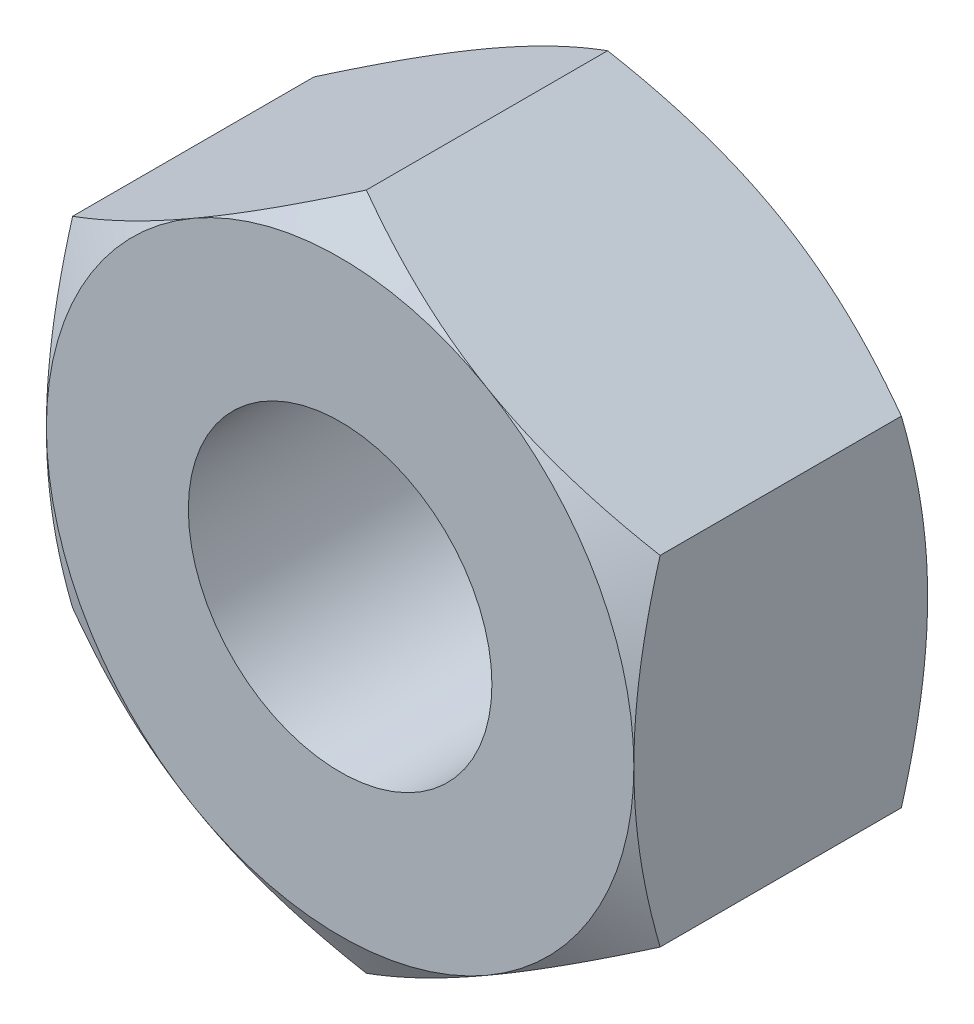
ISO-10303-21;
HEADER;
FILE_DESCRIPTION(('STEP AP214'),'2;1');
FILE_NAME('part.step','',(''),(''),'','','');
FILE_SCHEMA(('AUTOMOTIVE_DESIGN { 1 0 10303 214 1 1 1 1 }'));
ENDSEC;
DATA;
#1=APPLICATION_CONTEXT('core data for automotive mechanical design processes');
#2=APPLICATION_PROTOCOL_DEFINITION('international standard','automotive_design',2000,#1);
#3=PRODUCT_CONTEXT('',#1,'mechanical');
#4=PRODUCT('Part','Part','',(#3));
#5=PRODUCT_RELATED_PRODUCT_CATEGORY('part','',(#4));
#6=PRODUCT_DEFINITION_FORMATION('','',#4);
#7=PRODUCT_DEFINITION_CONTEXT('part definition',#1,'design');
#8=PRODUCT_DEFINITION('design','',#6,#7);
#9=PRODUCT_DEFINITION_SHAPE('','',#8);
#10=(LENGTH_UNIT() NAMED_UNIT(*) SI_UNIT(.MILLI.,.METRE.));
#11=(NAMED_UNIT(*) PLANE_ANGLE_UNIT() SI_UNIT($,.RADIAN.));
#12=(NAMED_UNIT(*) SI_UNIT($,.STERADIAN.) SOLID_ANGLE_UNIT());
#13=UNCERTAINTY_MEASURE_WITH_UNIT(LENGTH_MEASURE(1.E-05),#10,'distance_accuracy_value','');
#14=(GEOMETRIC_REPRESENTATION_CONTEXT(3) GLOBAL_UNCERTAINTY_ASSIGNED_CONTEXT((#13)) GLOBAL_UNIT_ASSIGNED_CONTEXT((#10,
#11,#12)) REPRESENTATION_CONTEXT('',''));
#15=CARTESIAN_POINT('',(0.,0.,0.));
#16=DIRECTION('',(0.,0.,1.));
#17=DIRECTION('',(1.,0.,0.));
#18=AXIS2_PLACEMENT_3D('',#15,#16,#17);
#19=CARTESIAN_POINT('',(13.,19.0358983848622,-72.));
#20=DIRECTION('',(-0.500000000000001,-0.866025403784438,0.));
#21=DIRECTION('',(0.866025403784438,-0.500000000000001,0.));
#22=AXIS2_PLACEMENT_3D('',#19,#20,#21);
#23=PLANE('',#22);
#24=CARTESIAN_POINT('',(12.9999999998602,19.0358983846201,-73.9999999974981));
#25=CARTESIAN_POINT('',(12.91511122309,19.0849089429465,-74.0000163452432));
#26=CARTESIAN_POINT('',(12.8302265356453,19.1339171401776,-73.9979201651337));
#27=CARTESIAN_POINT('',(12.6606238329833,19.2318373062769,-73.989624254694));
#28=CARTESIAN_POINT('',(12.5759057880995,19.280749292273,-73.9834253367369));
#29=CARTESIAN_POINT('',(12.4071835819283,19.3781611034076,-73.9670862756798));
#30=CARTESIAN_POINT('',(12.3231779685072,19.4266617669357,-73.9569659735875));
#31=CARTESIAN_POINT('',(12.15556697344,19.5234320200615,-73.9330018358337));
#32=CARTESIAN_POINT('',(12.0719616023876,19.5717016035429,-73.9191579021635));
#33=CARTESIAN_POINT('',(11.8220924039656,19.7159636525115,-73.872468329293));
#34=CARTESIAN_POINT('',(11.6565544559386,19.8115370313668,-73.8344422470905));
#35=CARTESIAN_POINT('',(11.3269021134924,20.0018619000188,-73.7467443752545));
#36=CARTESIAN_POINT('',(11.1627992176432,20.096606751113,-73.6970144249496));
#37=CARTESIAN_POINT('',(11.0000000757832,20.190598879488,-73.6427344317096));
#38=B_SPLINE_CURVE_WITH_KNOTS('',3,(#24,#25,#26,#27,#28,#29,#30,#31,#32,#33,#34,#35,#36,#37),
.UNSPECIFIED.,.F.,.F.,(4,2,2,2,2,2,4),(0.,0.294033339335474,0.588008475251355,0.880515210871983,
1.17302964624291,1.75729184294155,2.34452114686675),.UNSPECIFIED.);
#39=CARTESIAN_POINT('',(13.0000000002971,19.0358983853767,-73.9999999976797));
#40=VERTEX_POINT('',#39);
#41=CARTESIAN_POINT('',(11.000000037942,20.1905989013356,-73.6427344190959));
#42=VERTEX_POINT('',#41);
#43=EDGE_CURVE('E119',#40,#42,#38,.T.);
#44=ORIENTED_EDGE('',*,*,#43,.F.);
#45=CARTESIAN_POINT('',(15.0000000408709,17.8811978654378,-73.6427343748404));
#46=CARTESIAN_POINT('',(14.8372008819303,17.9751899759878,-73.6970143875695));
#47=CARTESIAN_POINT('',(14.6730979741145,18.0699348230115,-73.7467443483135));
#48=CARTESIAN_POINT('',(14.3434456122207,18.2602596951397,-73.834442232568));
#49=CARTESIAN_POINT('',(14.177907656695,18.3558330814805,-73.8724683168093));
#50=CARTESIAN_POINT('',(13.9280384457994,18.5000951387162,-73.9191578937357));
#51=CARTESIAN_POINT('',(13.8444330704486,18.5483647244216,-73.9330018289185));
#52=CARTESIAN_POINT('',(13.6768220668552,18.6451349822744,-73.9569659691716));
#53=CARTESIAN_POINT('',(13.5928164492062,18.6936356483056,-73.9670862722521));
#54=CARTESIAN_POINT('',(13.4240942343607,18.7910474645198,-73.9834253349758));
#55=CARTESIAN_POINT('',(13.3393761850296,18.8399594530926,-73.9896242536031));
#56=CARTESIAN_POINT('',(13.1697734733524,18.9378796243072,-73.9979201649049));
#57=CARTESIAN_POINT('',(13.0848887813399,18.9868878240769,-74.0000163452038));
#58=CARTESIAN_POINT('',(12.9999999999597,19.0358983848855,-73.9999999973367));
#59=B_SPLINE_CURVE_WITH_KNOTS('',3,(#45,#46,#47,#48,#49,#50,#51,#52,#53,#54,#55,#56,#57,#58),
.UNSPECIFIED.,.F.,.F.,(4,2,2,2,2,2,4),(0.,0.58722933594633,1.17149156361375,1.4640060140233,
1.75651276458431,2.05048791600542,2.34452127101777),.UNSPECIFIED.);
#60=CARTESIAN_POINT('',(15.0000000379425,17.881197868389,-73.642734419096));
#61=VERTEX_POINT('',#60);
#62=EDGE_CURVE('E228',#61,#40,#59,.T.);
#63=ORIENTED_EDGE('',*,*,#62,.F.);
#64=DIRECTION('',(0.,0.,1.));
#65=VECTOR('',#64,1.);
#66=CARTESIAN_POINT('',(15.,17.881197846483,-72.));
#67=LINE('',#66,#65);
#68=CARTESIAN_POINT('',(15.0000000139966,17.881197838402,-70.3572655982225));
#69=VERTEX_POINT('',#68);
#70=EDGE_CURVE('E306',#69,#61,#67,.F.);
#71=ORIENTED_EDGE('',*,*,#70,.F.);
#72=CARTESIAN_POINT('',(12.9999999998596,19.0358983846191,-70.0000000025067));
#73=CARTESIAN_POINT('',(13.0848887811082,18.9868878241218,-69.9999836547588));
#74=CARTESIAN_POINT('',(13.1697734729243,18.9378796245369,-70.0020798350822));
#75=CARTESIAN_POINT('',(13.3393761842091,18.8399594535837,-70.0103757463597));
#76=CARTESIAN_POINT('',(13.4240942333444,18.7910474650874,-70.0165746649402));
#77=CARTESIAN_POINT('',(13.5928164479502,18.6936356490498,-70.0329137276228));
#78=CARTESIAN_POINT('',(13.6768220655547,18.6451349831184,-70.043034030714));
#79=CARTESIAN_POINT('',(13.8444330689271,18.5483647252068,-70.0669981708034));
#80=CARTESIAN_POINT('',(13.9280384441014,18.5000951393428,-70.0808421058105));
#81=CARTESIAN_POINT('',(14.1779076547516,18.3558330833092,-70.1275316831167));
#82=CARTESIAN_POINT('',(14.3434456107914,18.2602596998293,-70.1655577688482));
#83=CARTESIAN_POINT('',(14.6730979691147,18.0699348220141,-70.2532556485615));
#84=CARTESIAN_POINT('',(14.8372008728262,17.9751899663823,-70.3029856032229));
#85=CARTESIAN_POINT('',(15.0000000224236,17.8811978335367,-70.3572656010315));
#86=B_SPLINE_CURVE_WITH_KNOTS('',3,(#72,#73,#74,#75,#76,#77,#78,#79,#80,#81,#82,#83,#84,#85),
.UNSPECIFIED.,.F.,.F.,(4,2,2,2,2,2,4),(0.,0.294033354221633,0.588008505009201,0.880515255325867,
1.17302970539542,1.75729193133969,2.34452126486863),.UNSPECIFIED.);
#87=CARTESIAN_POINT('',(13.0000000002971,19.0358983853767,-70.0000000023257));
#88=VERTEX_POINT('',#87);
#89=EDGE_CURVE('E246',#88,#69,#86,.T.);
#90=ORIENTED_EDGE('',*,*,#89,.F.);
#91=CARTESIAN_POINT('',(11.0000000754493,20.1905988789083,-70.3572655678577));
#92=CARTESIAN_POINT('',(11.1627992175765,20.09660675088,-70.302985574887));
#93=CARTESIAN_POINT('',(11.3269021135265,20.0018618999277,-70.2532556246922));
#94=CARTESIAN_POINT('',(11.6565544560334,19.8115370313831,-70.1655577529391));
#95=CARTESIAN_POINT('',(11.8220924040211,19.715963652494,-70.1275316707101));
#96=CARTESIAN_POINT('',(12.0719616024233,19.571701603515,-70.0808420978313));
#97=CARTESIAN_POINT('',(12.1555669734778,19.5234320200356,-70.0669981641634));
#98=CARTESIAN_POINT('',(12.3231779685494,19.4266617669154,-70.0430340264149));
#99=CARTESIAN_POINT('',(12.4071835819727,19.3781611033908,-70.0329137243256));
#100=CARTESIAN_POINT('',(12.5759057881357,19.2807492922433,-70.0165746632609));
#101=CARTESIAN_POINT('',(12.660623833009,19.2318373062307,-70.0103757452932));
#102=CARTESIAN_POINT('',(12.8302265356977,19.1339171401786,-70.0020798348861));
#103=CARTESIAN_POINT('',(12.9151112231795,19.0849089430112,-69.9999836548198));
#104=CARTESIAN_POINT('',(13.0000000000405,19.0358983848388,-70.0000000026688));
#105=B_SPLINE_CURVE_WITH_KNOTS('',3,(#91,#92,#93,#94,#95,#96,#97,#98,#99,#100,#101,#102,#103,
#104),.UNSPECIFIED.,.F.,.F.,(4,2,2,2,2,2,4),(0.,0.587229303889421,1.17149150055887,
1.46400593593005,1.75651267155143,2.0504878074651,2.34452114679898),.UNSPECIFIED.);
#106=CARTESIAN_POINT('',(11.,20.190598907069,-70.3572655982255));
#107=VERTEX_POINT('',#106);
#108=EDGE_CURVE('E253',#107,#88,#105,.T.);
#109=ORIENTED_EDGE('',*,*,#108,.F.);
#110=DIRECTION('',(0.,0.,1.));
#111=VECTOR('',#110,1.);
#112=CARTESIAN_POINT('',(11.,20.1905989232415,-72.));
#113=LINE('',#112,#111);
#114=EDGE_CURVE('E302',#42,#107,#113,.T.);
#115=ORIENTED_EDGE('',*,*,#114,.F.);
#116=EDGE_LOOP('',(#44,#63,#71,#90,#109,#115));
#117=FACE_BOUND('',#116,.T.);
#118=ADVANCED_FACE('F15',(#117),#23,.T.);
#119=CARTESIAN_POINT('',(11.,22.5,-72.));
#120=DIRECTION('',(-1.,0.,0.));
#121=DIRECTION('',(0.,0.,1.));
#122=AXIS2_PLACEMENT_3D('',#119,#120,#121);
#123=PLANE('',#122);
#124=CARTESIAN_POINT('',(10.9999999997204,22.5,-73.9999999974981));
#125=CARTESIAN_POINT('',(10.9999999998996,22.5980211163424,-74.0000163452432));
#126=CARTESIAN_POINT('',(10.9999999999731,22.6960375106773,-73.9979201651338));
#127=CARTESIAN_POINT('',(11.0000000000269,22.8918778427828,-73.989624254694));
#128=CARTESIAN_POINT('',(11.0000000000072,22.9897018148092,-73.9834253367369));
#129=CARTESIAN_POINT('',(10.9999999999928,23.1845254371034,-73.9670862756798));
#130=CARTESIAN_POINT('',(10.999999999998,23.2815267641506,-73.9569659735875));
#131=CARTESIAN_POINT('',(11.000000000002,23.4750672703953,-73.9330018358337));
#132=CARTESIAN_POINT('',(11.0000000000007,23.5716064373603,-73.9191579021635));
#133=CARTESIAN_POINT('',(10.9999999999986,23.8601305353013,-73.8724683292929));
#134=CARTESIAN_POINT('',(10.9999999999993,24.0512772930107,-73.8344422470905));
#135=CARTESIAN_POINT('',(11.0000000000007,24.4319270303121,-73.7467443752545));
#136=CARTESIAN_POINT('',(11.0000000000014,24.6214167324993,-73.6970144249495));
#137=CARTESIAN_POINT('',(11.,24.8094009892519,-73.6427344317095));
#138=B_SPLINE_CURVE_WITH_KNOTS('',3,(#124,#125,#126,#127,#128,#129,#130,#131,#132,#133,#134,
#135,#136,#137),.UNSPECIFIED.,.F.,.F.,(4,2,2,2,2,2,4),(0.,0.294033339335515,0.588008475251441,
0.880515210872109,1.17302964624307,1.75729184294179,2.34452114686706),.UNSPECIFIED.);
#139=CARTESIAN_POINT('',(11.0000000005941,22.5,-73.9999999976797));
#140=VERTEX_POINT('',#139);
#141=CARTESIAN_POINT('',(11.,24.809401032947,-73.6427344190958));
#142=VERTEX_POINT('',#141);
#143=EDGE_CURVE('E116',#140,#142,#138,.T.);
#144=ORIENTED_EDGE('',*,*,#143,.F.);
#145=CARTESIAN_POINT('',(11.0000000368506,20.1905988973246,-73.6427343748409));
#146=CARTESIAN_POINT('',(11.0000000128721,20.3785831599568,-73.6970143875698));
#147=CARTESIAN_POINT('',(11.0000000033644,20.568072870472,-73.7467443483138));
#148=CARTESIAN_POINT('',(10.9999999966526,20.9487226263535,-73.8344422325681));
#149=CARTESIAN_POINT('',(10.9999999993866,21.1398693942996,-73.8724683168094));
#150=CARTESIAN_POINT('',(11.0000000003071,21.4283935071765,-73.9191578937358));
#151=CARTESIAN_POINT('',(11.0000000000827,21.5249326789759,-73.9330018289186));
#152=CARTESIAN_POINT('',(10.9999999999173,21.718473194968,-73.9569659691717));
#153=CARTESIAN_POINT('',(10.9999999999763,21.8154745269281,-73.9670862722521));
#154=CARTESIAN_POINT('',(11.0000000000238,22.0102981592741,-73.9834253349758));
#155=CARTESIAN_POINT('',(11.0000000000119,22.1081221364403,-73.9896242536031));
#156=CARTESIAN_POINT('',(10.9999999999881,22.3039624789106,-73.9979201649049));
#157=CARTESIAN_POINT('',(10.9999999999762,22.4019788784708,-74.0000163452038));
#158=CARTESIAN_POINT('',(11.,22.5000000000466,-73.9999999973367));
#159=B_SPLINE_CURVE_WITH_KNOTS('',3,(#145,#146,#147,#148,#149,#150,#151,#152,#153,#154,#155,
#156,#157,#158),.UNSPECIFIED.,.F.,.F.,(4,2,2,2,2,2,4),(0.,0.587229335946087,1.17149156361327,
1.4640060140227,1.75651276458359,2.05048791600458,2.34452127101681),.UNSPECIFIED.);
#160=EDGE_CURVE('E333',#42,#140,#159,.T.);
#161=ORIENTED_EDGE('',*,*,#160,.F.);
#162=ORIENTED_EDGE('',*,*,#114,.T.);
#163=CARTESIAN_POINT('',(10.9999999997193,22.5,-70.0000000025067));
#164=CARTESIAN_POINT('',(10.9999999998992,22.4019788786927,-69.9999836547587));
#165=CARTESIAN_POINT('',(10.999999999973,22.3039624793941,-70.0020798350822));
#166=CARTESIAN_POINT('',(11.000000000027,22.1081221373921,-70.0103757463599));
#167=CARTESIAN_POINT('',(11.0000000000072,22.0102981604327,-70.0165746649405));
#168=CARTESIAN_POINT('',(10.9999999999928,21.8154745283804,-70.0329137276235));
#169=CARTESIAN_POINT('',(10.999999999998,21.7184731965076,-70.0430340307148));
#170=CARTESIAN_POINT('',(11.000000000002,21.5249326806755,-70.0669981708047));
#171=CARTESIAN_POINT('',(11.0000000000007,21.4283935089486,-70.0808421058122));
#172=CARTESIAN_POINT('',(10.9999999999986,21.1398693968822,-70.1275316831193));
#173=CARTESIAN_POINT('',(10.9999999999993,20.9487226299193,-70.1655577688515));
#174=CARTESIAN_POINT('',(11.0000000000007,20.5680728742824,-70.2532556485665));
#175=CARTESIAN_POINT('',(11.0000000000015,20.3785831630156,-70.3029856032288));
#176=CARTESIAN_POINT('',(11.,20.1905988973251,-70.3572656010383));
#177=B_SPLINE_CURVE_WITH_KNOTS('',3,(#163,#164,#165,#166,#167,#168,#169,#170,#171,#172,#173,
#174,#175,#176),.UNSPECIFIED.,.F.,.F.,(4,2,2,2,2,2,4),(0.,0.294033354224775,0.588008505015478,
0.88051525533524,1.17302970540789,1.75729193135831,2.34452126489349),.UNSPECIFIED.);
#178=CARTESIAN_POINT('',(11.0000000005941,22.5,-70.0000000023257));
#179=VERTEX_POINT('',#178);
#180=EDGE_CURVE('E258',#179,#107,#177,.T.);
#181=ORIENTED_EDGE('',*,*,#180,.F.);
#182=CARTESIAN_POINT('',(10.9999999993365,24.8094009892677,-70.3572655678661));
#183=CARTESIAN_POINT('',(10.9999999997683,24.6214167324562,-70.3029855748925));
#184=CARTESIAN_POINT('',(10.9999999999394,24.4319270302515,-70.2532556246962));
#185=CARTESIAN_POINT('',(11.0000000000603,24.0512772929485,-70.1655577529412));
#186=CARTESIAN_POINT('',(11.000000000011,23.8601305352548,-70.1275316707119));
#187=CARTESIAN_POINT('',(10.9999999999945,23.5716064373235,-70.0808420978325));
#188=CARTESIAN_POINT('',(10.9999999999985,23.475067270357,-70.0669981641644));
#189=CARTESIAN_POINT('',(11.0000000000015,23.2815267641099,-70.0430340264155));
#190=CARTESIAN_POINT('',(11.0000000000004,23.1845254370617,-70.032913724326));
#191=CARTESIAN_POINT('',(10.9999999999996,22.9897018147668,-70.0165746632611));
#192=CARTESIAN_POINT('',(10.9999999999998,22.8918778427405,-70.0103757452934));
#193=CARTESIAN_POINT('',(11.0000000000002,22.6960375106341,-70.0020798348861));
#194=CARTESIAN_POINT('',(11.0000000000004,22.598021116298,-69.9999836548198));
#195=CARTESIAN_POINT('',(11.,22.4999999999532,-70.0000000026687));
#196=B_SPLINE_CURVE_WITH_KNOTS('',3,(#182,#183,#184,#185,#186,#187,#188,#189,#190,#191,#192,
#193,#194,#195),.UNSPECIFIED.,.F.,.F.,(4,2,2,2,2,2,4),(0.,0.587229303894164,1.1714915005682,
1.46400593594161,1.7565126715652,2.05048780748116,2.34452114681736),.UNSPECIFIED.);
#197=CARTESIAN_POINT('',(10.9999999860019,24.8094010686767,-70.357265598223));
#198=VERTEX_POINT('',#197);
#199=EDGE_CURVE('E283',#198,#179,#196,.T.);
#200=ORIENTED_EDGE('',*,*,#199,.F.);
#201=DIRECTION('',(0.,0.,1.));
#202=VECTOR('',#201,1.);
#203=CARTESIAN_POINT('',(11.,24.8094010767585,-72.));
#204=LINE('',#203,#202);
#205=EDGE_CURVE('E334',#142,#198,#204,.T.);
#206=ORIENTED_EDGE('',*,*,#205,.F.);
#207=EDGE_LOOP('',(#144,#161,#162,#181,#200,#206));
#208=FACE_BOUND('',#207,.T.);
#209=ADVANCED_FACE('F241',(#208),#123,.T.);
#210=CARTESIAN_POINT('',(13.,25.9641016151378,-72.));
#211=DIRECTION('',(-0.500000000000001,0.866025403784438,0.));
#212=DIRECTION('',(-0.866025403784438,-0.500000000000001,0.));
#213=AXIS2_PLACEMENT_3D('',#210,#211,#212);
#214=PLANE('',#213);
#215=CARTESIAN_POINT('',(12.9999999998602,25.9641016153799,-73.9999999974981));
#216=CARTESIAN_POINT('',(13.0848887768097,26.013112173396,-74.0000163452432));
#217=CARTESIAN_POINT('',(13.1697734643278,26.0621203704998,-73.9979201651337));
#218=CARTESIAN_POINT('',(13.3393761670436,26.1600405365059,-73.989624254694));
#219=CARTESIAN_POINT('',(13.4240942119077,26.2089525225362,-73.9834253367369));
#220=CARTESIAN_POINT('',(13.5928164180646,26.3063643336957,-73.9670862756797));
#221=CARTESIAN_POINT('',(13.6768220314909,26.3548649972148,-73.9569659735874));
#222=CARTESIAN_POINT('',(13.844433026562,26.4516352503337,-73.9330018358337));
#223=CARTESIAN_POINT('',(13.9280383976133,26.4999048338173,-73.9191579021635));
#224=CARTESIAN_POINT('',(14.1779075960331,26.6441668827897,-73.8724683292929));
#225=CARTESIAN_POINT('',(14.3434455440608,26.7397402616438,-73.8344422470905));
#226=CARTESIAN_POINT('',(14.6730978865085,26.9300651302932,-73.7467443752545));
#227=CARTESIAN_POINT('',(14.8372007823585,27.0248099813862,-73.6970144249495));
#228=CARTESIAN_POINT('',(14.999999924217,27.1188021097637,-73.6427344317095));
#229=B_SPLINE_CURVE_WITH_KNOTS('',3,(#215,#216,#217,#218,#219,#220,#221,#222,#223,#224,#225,
#226,#227,#228),.UNSPECIFIED.,.F.,.F.,(4,2,2,2,2,2,4),(0.,0.29403333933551,0.588008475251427,
0.880515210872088,1.17302964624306,1.75729184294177,2.34452114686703),.UNSPECIFIED.);
#230=CARTESIAN_POINT('',(13.0000000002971,25.9641016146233,-73.9999999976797));
#231=VERTEX_POINT('',#230);
#232=CARTESIAN_POINT('',(14.9999999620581,27.1188021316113,-73.6427344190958));
#233=VERTEX_POINT('',#232);
#234=EDGE_CURVE('E19',#231,#233,#229,.T.);
#235=ORIENTED_EDGE('',*,*,#234,.F.);
#236=CARTESIAN_POINT('',(10.9999999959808,24.8094010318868,-73.642734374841));
#237=CARTESIAN_POINT('',(11.1627991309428,24.9033931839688,-73.6970143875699));
#238=CARTESIAN_POINT('',(11.3269020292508,24.9981380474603,-73.7467443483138));
#239=CARTESIAN_POINT('',(11.6565543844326,25.1884629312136,-73.8344422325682));
#240=CARTESIAN_POINT('',(11.8220923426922,25.284036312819,-73.8724683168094));
#241=CARTESIAN_POINT('',(12.0719615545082,25.4282983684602,-73.9191578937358));
#242=CARTESIAN_POINT('',(12.1555669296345,25.4765679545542,-73.9330018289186));
#243=CARTESIAN_POINT('',(12.3231779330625,25.5733382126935,-73.9569659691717));
#244=CARTESIAN_POINT('',(12.4071835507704,25.6218388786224,-73.9670862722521));
#245=CARTESIAN_POINT('',(12.5759057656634,25.7192506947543,-73.9834253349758));
#246=CARTESIAN_POINT('',(12.6606238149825,25.7681626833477,-73.9896242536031));
#247=CARTESIAN_POINT('',(12.8302265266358,25.8660828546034,-73.9979201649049));
#248=CARTESIAN_POINT('',(12.9151112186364,25.9150910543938,-74.0000163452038));
#249=CARTESIAN_POINT('',(13.0000000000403,25.9641016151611,-73.9999999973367));
#250=B_SPLINE_CURVE_WITH_KNOTS('',3,(#236,#237,#238,#239,#240,#241,#242,#243,#244,#245,#246,
#247,#248,#249),.UNSPECIFIED.,.F.,.F.,(4,2,2,2,2,2,4),(0.,0.587229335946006,1.17149156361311,
1.46400601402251,1.75651276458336,2.05048791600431,2.34452127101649),.UNSPECIFIED.);
#251=EDGE_CURVE('E110',#142,#231,#250,.T.);
#252=ORIENTED_EDGE('',*,*,#251,.F.);
#253=ORIENTED_EDGE('',*,*,#205,.T.);
#254=CARTESIAN_POINT('',(12.9999999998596,25.9641016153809,-70.0000000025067));
#255=CARTESIAN_POINT('',(12.9151112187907,25.9150910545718,-69.9999836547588));
#256=CARTESIAN_POINT('',(12.8302265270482,25.866082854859,-70.0020798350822));
#257=CARTESIAN_POINT('',(12.6606238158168,25.7681626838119,-70.0103757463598));
#258=CARTESIAN_POINT('',(12.5759057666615,25.7192506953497,-70.0165746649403));
#259=CARTESIAN_POINT('',(12.4071835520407,25.6218388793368,-70.0329137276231));
#260=CARTESIAN_POINT('',(12.3231779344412,25.5733382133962,-70.0430340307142));
#261=CARTESIAN_POINT('',(12.1555669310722,25.4765679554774,-70.0669981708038));
#262=CARTESIAN_POINT('',(12.0719615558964,25.4282983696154,-70.080842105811));
#263=CARTESIAN_POINT('',(11.8220923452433,25.2840363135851,-70.1275316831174));
#264=CARTESIAN_POINT('',(11.6565543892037,25.1884629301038,-70.1655577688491));
#265=CARTESIAN_POINT('',(11.3269020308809,24.9981380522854,-70.253255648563));
#266=CARTESIAN_POINT('',(11.1627991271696,24.9033931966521,-70.3029856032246));
#267=CARTESIAN_POINT('',(10.9999999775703,24.8094010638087,-70.3572656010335));
#268=B_SPLINE_CURVE_WITH_KNOTS('',3,(#254,#255,#256,#257,#258,#259,#260,#261,#262,#263,#264,
#265,#266,#267),.UNSPECIFIED.,.F.,.F.,(4,2,2,2,2,2,4),(0.,0.294033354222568,0.58800850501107,
0.880515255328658,1.17302970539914,1.75729193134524,2.34452126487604),.UNSPECIFIED.);
#269=CARTESIAN_POINT('',(13.0000000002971,25.9641016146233,-70.0000000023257));
#270=VERTEX_POINT('',#269);
#271=EDGE_CURVE('E278',#270,#198,#268,.T.);
#272=ORIENTED_EDGE('',*,*,#271,.F.);
#273=CARTESIAN_POINT('',(14.9999999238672,27.1188021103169,-70.3572655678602));
#274=CARTESIAN_POINT('',(14.8372007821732,27.0248099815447,-70.3029855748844));
#275=CARTESIAN_POINT('',(14.6730978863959,26.930065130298,-70.2532556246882));
#276=CARTESIAN_POINT('',(14.343445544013,26.7397402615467,-70.1655577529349));
#277=CARTESIAN_POINT('',(14.1779075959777,26.6441668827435,-70.1275316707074));
#278=CARTESIAN_POINT('',(13.9280383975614,26.4999048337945,-70.0808420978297));
#279=CARTESIAN_POINT('',(13.8444330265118,26.4516352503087,-70.066998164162));
#280=CARTESIAN_POINT('',(13.676822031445,26.3548649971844,-70.043034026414));
#281=CARTESIAN_POINT('',(13.5928164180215,26.3063643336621,-70.0329137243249));
#282=CARTESIAN_POINT('',(13.4240942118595,26.2089525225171,-70.0165746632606));
#283=CARTESIAN_POINT('',(13.3393761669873,26.1600405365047,-70.010375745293));
#284=CARTESIAN_POINT('',(13.1697734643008,26.0621203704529,-70.0020798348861));
#285=CARTESIAN_POINT('',(13.08488877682,26.0131121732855,-69.9999836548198));
#286=CARTESIAN_POINT('',(12.9999999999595,25.9641016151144,-70.0000000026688));
#287=B_SPLINE_CURVE_WITH_KNOTS('',3,(#273,#274,#275,#276,#277,#278,#279,#280,#281,#282,#283,
#284,#285,#286),.UNSPECIFIED.,.F.,.F.,(4,2,2,2,2,2,4),(0.,0.587229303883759,1.17149150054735,
1.46400593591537,1.75651267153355,2.05048780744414,2.34452114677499),.UNSPECIFIED.);
#288=CARTESIAN_POINT('',(14.9999999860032,27.1188021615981,-70.3572655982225));
#289=VERTEX_POINT('',#288);
#290=EDGE_CURVE('E291',#289,#270,#287,.T.);
#291=ORIENTED_EDGE('',*,*,#290,.F.);
#292=DIRECTION('',(0.,0.,1.));
#293=VECTOR('',#292,1.);
#294=CARTESIAN_POINT('',(15.,27.118802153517,-72.));
#295=LINE('',#294,#293);
#296=EDGE_CURVE('E125',#233,#289,#295,.T.);
#297=ORIENTED_EDGE('',*,*,#296,.F.);
#298=EDGE_LOOP('',(#235,#252,#253,#272,#291,#297));
#299=FACE_BOUND('',#298,.T.);
#300=ADVANCED_FACE('F123',(#299),#214,.T.);
#301=CARTESIAN_POINT('',(17.,25.9641016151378,-72.));
#302=DIRECTION('',(0.500000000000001,0.866025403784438,0.));
#303=DIRECTION('',(-0.866025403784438,0.500000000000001,0.));
#304=AXIS2_PLACEMENT_3D('',#301,#302,#303);
#305=PLANE('',#304);
#306=CARTESIAN_POINT('',(17.0000000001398,25.9641016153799,-73.9999999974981));
#307=CARTESIAN_POINT('',(17.08488877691,25.9150910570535,-74.0000163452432));
#308=CARTESIAN_POINT('',(17.1697734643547,25.8660828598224,-73.9979201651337));
#309=CARTESIAN_POINT('',(17.3393761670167,25.7681626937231,-73.989624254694));
#310=CARTESIAN_POINT('',(17.4240942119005,25.719250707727,-73.9834253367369));
#311=CARTESIAN_POINT('',(17.5928164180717,25.6218388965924,-73.9670862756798));
#312=CARTESIAN_POINT('',(17.6768220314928,25.5733382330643,-73.9569659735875));
#313=CARTESIAN_POINT('',(17.84443302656,25.4765679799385,-73.9330018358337));
#314=CARTESIAN_POINT('',(17.9280383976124,25.4282983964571,-73.9191579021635));
#315=CARTESIAN_POINT('',(18.1779075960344,25.2840363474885,-73.872468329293));
#316=CARTESIAN_POINT('',(18.3434455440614,25.1884629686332,-73.8344422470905));
#317=CARTESIAN_POINT('',(18.6730978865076,24.9981380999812,-73.7467443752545));
#318=CARTESIAN_POINT('',(18.8372007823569,24.903393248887,-73.6970144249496));
#319=CARTESIAN_POINT('',(18.9999999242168,24.809401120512,-73.6427344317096));
#320=B_SPLINE_CURVE_WITH_KNOTS('',3,(#306,#307,#308,#309,#310,#311,#312,#313,#314,#315,#316,
#317,#318,#319),.UNSPECIFIED.,.F.,.F.,(4,2,2,2,2,2,4),(0.,0.294033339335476,0.588008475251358,
0.880515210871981,1.17302964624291,1.75729184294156,2.34452114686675),.UNSPECIFIED.);
#321=CARTESIAN_POINT('',(16.9999999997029,25.9641016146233,-73.9999999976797));
#322=VERTEX_POINT('',#321);
#323=CARTESIAN_POINT('',(18.999999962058,24.8094010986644,-73.6427344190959));
#324=VERTEX_POINT('',#323);
#325=EDGE_CURVE('E191',#322,#324,#320,.T.);
#326=ORIENTED_EDGE('',*,*,#325,.F.);
#327=CARTESIAN_POINT('',(14.9999999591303,27.1188021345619,-73.642734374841));
#328=CARTESIAN_POINT('',(15.1627991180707,27.0248100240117,-73.6970143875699));
#329=CARTESIAN_POINT('',(15.3269020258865,26.930065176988,-73.7467443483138));
#330=CARTESIAN_POINT('',(15.65655438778,26.7397403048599,-73.8344422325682));
#331=CARTESIAN_POINT('',(15.8220923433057,26.6441669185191,-73.8724683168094));
#332=CARTESIAN_POINT('',(16.0719615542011,26.4999048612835,-73.9191578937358));
#333=CARTESIAN_POINT('',(16.1555669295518,26.4516352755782,-73.9330018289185));
#334=CARTESIAN_POINT('',(16.3231779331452,26.3548650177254,-73.9569659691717));
#335=CARTESIAN_POINT('',(16.4071835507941,26.3063643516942,-73.9670862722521));
#336=CARTESIAN_POINT('',(16.5759057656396,26.2089525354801,-73.9834253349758));
#337=CARTESIAN_POINT('',(16.6606238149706,26.1600405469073,-73.9896242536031));
#338=CARTESIAN_POINT('',(16.8302265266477,26.0621203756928,-73.9979201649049));
#339=CARTESIAN_POINT('',(16.9151112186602,26.013112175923,-74.0000163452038));
#340=CARTESIAN_POINT('',(17.0000000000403,25.9641016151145,-73.9999999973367));
#341=B_SPLINE_CURVE_WITH_KNOTS('',3,(#327,#328,#329,#330,#331,#332,#333,#334,#335,#336,#337,
#338,#339,#340),.UNSPECIFIED.,.F.,.F.,(4,2,2,2,2,2,4),(0.,0.587229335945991,1.17149156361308,
1.46400601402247,1.75651276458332,2.05048791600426,2.34452127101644),.UNSPECIFIED.);
#342=EDGE_CURVE('E129',#233,#322,#341,.T.);
#343=ORIENTED_EDGE('',*,*,#342,.F.);
#344=ORIENTED_EDGE('',*,*,#296,.T.);
#345=CARTESIAN_POINT('',(17.0000000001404,25.9641016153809,-70.0000000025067));
#346=CARTESIAN_POINT('',(16.9151112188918,26.0131121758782,-69.9999836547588));
#347=CARTESIAN_POINT('',(16.8302265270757,26.0621203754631,-70.0020798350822));
#348=CARTESIAN_POINT('',(16.6606238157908,26.1600405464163,-70.0103757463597));
#349=CARTESIAN_POINT('',(16.5759057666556,26.2089525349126,-70.0165746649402));
#350=CARTESIAN_POINT('',(16.4071835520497,26.3063643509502,-70.0329137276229));
#351=CARTESIAN_POINT('',(16.3231779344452,26.3548650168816,-70.043034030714));
#352=CARTESIAN_POINT('',(16.1555669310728,26.4516352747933,-70.0669981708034));
#353=CARTESIAN_POINT('',(16.0719615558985,26.4999048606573,-70.0808421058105));
#354=CARTESIAN_POINT('',(15.8220923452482,26.6441669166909,-70.1275316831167));
#355=CARTESIAN_POINT('',(15.6565543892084,26.7397403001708,-70.1655577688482));
#356=CARTESIAN_POINT('',(15.3269020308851,26.9300651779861,-70.2532556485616));
#357=CARTESIAN_POINT('',(15.1627991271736,27.0248100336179,-70.3029856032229));
#358=CARTESIAN_POINT('',(14.9999999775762,27.1188021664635,-70.3572656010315));
#359=B_SPLINE_CURVE_WITH_KNOTS('',3,(#345,#346,#347,#348,#349,#350,#351,#352,#353,#354,#355,
#356,#357,#358),.UNSPECIFIED.,.F.,.F.,(4,2,2,2,2,2,4),(0.,0.294033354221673,0.588008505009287,
0.880515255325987,1.17302970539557,1.75729193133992,2.34452126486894),.UNSPECIFIED.);
#360=CARTESIAN_POINT('',(16.9999999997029,25.9641016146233,-70.0000000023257));
#361=VERTEX_POINT('',#360);
#362=EDGE_CURVE('E393',#361,#289,#359,.T.);
#363=ORIENTED_EDGE('',*,*,#362,.F.);
#364=CARTESIAN_POINT('',(18.9999999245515,24.8094011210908,-70.3572655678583));
#365=CARTESIAN_POINT('',(18.8372007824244,24.9033932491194,-70.3029855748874));
#366=CARTESIAN_POINT('',(18.6730978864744,24.9981381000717,-70.2532556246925));
#367=CARTESIAN_POINT('',(18.3434455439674,25.1884629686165,-70.1655577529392));
#368=CARTESIAN_POINT('',(18.1779075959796,25.2840363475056,-70.1275316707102));
#369=CARTESIAN_POINT('',(17.9280383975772,25.4282983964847,-70.0808420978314));
#370=CARTESIAN_POINT('',(17.8444330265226,25.4765679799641,-70.0669981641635));
#371=CARTESIAN_POINT('',(17.676822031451,25.5733382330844,-70.043034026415));
#372=CARTESIAN_POINT('',(17.5928164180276,25.621838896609,-70.0329137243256));
#373=CARTESIAN_POINT('',(17.4240942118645,25.7192507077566,-70.0165746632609));
#374=CARTESIAN_POINT('',(17.3393761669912,25.7681626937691,-70.0103757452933));
#375=CARTESIAN_POINT('',(17.1697734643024,25.8660828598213,-70.0020798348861));
#376=CARTESIAN_POINT('',(17.0848887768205,25.9150910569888,-69.9999836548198));
#377=CARTESIAN_POINT('',(16.9999999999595,25.9641016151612,-70.0000000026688));
#378=B_SPLINE_CURVE_WITH_KNOTS('',3,(#364,#365,#366,#367,#368,#369,#370,#371,#372,#373,#374,
#375,#376,#377),.UNSPECIFIED.,.F.,.F.,(4,2,2,2,2,2,4),(0.,0.587229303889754,1.17149150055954,
1.46400593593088,1.75651267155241,2.05048780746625,2.34452114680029),.UNSPECIFIED.);
#379=CARTESIAN_POINT('',(19.,24.8094010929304,-70.3572655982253));
#380=VERTEX_POINT('',#379);
#381=EDGE_CURVE('E394',#380,#361,#378,.T.);
#382=ORIENTED_EDGE('',*,*,#381,.F.);
#383=DIRECTION('',(0.,0.,-1.));
#384=VECTOR('',#383,1.);
#385=CARTESIAN_POINT('',(19.,24.8094010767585,-72.));
#386=LINE('',#385,#384);
#387=EDGE_CURVE('E130',#324,#380,#386,.F.);
#388=ORIENTED_EDGE('',*,*,#387,.F.);
#389=EDGE_LOOP('',(#326,#343,#344,#363,#382,#388));
#390=FACE_BOUND('',#389,.T.);
#391=ADVANCED_FACE('F404',(#390),#305,.T.);
#392=CARTESIAN_POINT('',(17.,19.0358983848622,-72.));
#393=DIRECTION('',(0.500000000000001,-0.866025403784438,0.));
#394=DIRECTION('',(0.866025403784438,0.500000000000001,0.));
#395=AXIS2_PLACEMENT_3D('',#392,#393,#394);
#396=PLANE('',#395);
#397=CARTESIAN_POINT('',(15.0000000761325,17.8811978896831,-70.3572655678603));
#398=CARTESIAN_POINT('',(15.1627992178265,17.9751900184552,-70.3029855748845));
#399=CARTESIAN_POINT('',(15.3269021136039,18.0699348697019,-70.2532556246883));
#400=CARTESIAN_POINT('',(15.6565544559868,18.2602597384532,-70.165557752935));
#401=CARTESIAN_POINT('',(15.8220924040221,18.3558331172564,-70.1275316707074));
#402=CARTESIAN_POINT('',(16.0719616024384,18.5000951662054,-70.0808420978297));
#403=CARTESIAN_POINT('',(16.1555669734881,18.5483647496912,-70.066998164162));
#404=CARTESIAN_POINT('',(16.3231779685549,18.6451350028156,-70.043034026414));
#405=CARTESIAN_POINT('',(16.4071835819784,18.6936356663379,-70.0329137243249));
#406=CARTESIAN_POINT('',(16.5759057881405,18.7910474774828,-70.0165746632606));
#407=CARTESIAN_POINT('',(16.6606238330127,18.8399594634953,-70.010375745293));
#408=CARTESIAN_POINT('',(16.8302265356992,18.9378796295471,-70.0020798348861));
#409=CARTESIAN_POINT('',(16.9151112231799,18.9868878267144,-69.9999836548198));
#410=CARTESIAN_POINT('',(17.0000000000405,19.0358983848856,-70.0000000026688));
#411=B_SPLINE_CURVE_WITH_KNOTS('',3,(#397,#398,#399,#400,#401,#402,#403,#404,#405,#406,#407,
#408,#409,#410),.UNSPECIFIED.,.F.,.F.,(4,2,2,2,2,2,4),(0.,0.587229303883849,1.17149150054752,
1.46400593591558,1.7565126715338,2.05048780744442,2.34452114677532),.UNSPECIFIED.);
#412=CARTESIAN_POINT('',(16.9999999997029,19.0358983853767,-70.0000000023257));
#413=VERTEX_POINT('',#412);
#414=EDGE_CURVE('E190',#69,#413,#411,.T.);
#415=ORIENTED_EDGE('',*,*,#414,.F.);
#416=ORIENTED_EDGE('',*,*,#70,.T.);
#417=CARTESIAN_POINT('',(17.0000000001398,19.0358983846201,-73.9999999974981));
#418=CARTESIAN_POINT('',(16.9151112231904,18.9868878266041,-74.0000163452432));
#419=CARTESIAN_POINT('',(16.8302265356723,18.9378796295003,-73.9979201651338));
#420=CARTESIAN_POINT('',(16.6606238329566,18.8399594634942,-73.989624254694));
#421=CARTESIAN_POINT('',(16.5759057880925,18.791047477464,-73.9834253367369));
#422=CARTESIAN_POINT('',(16.4071835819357,18.6936356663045,-73.9670862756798));
#423=CARTESIAN_POINT('',(16.3231779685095,18.6451350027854,-73.9569659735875));
#424=CARTESIAN_POINT('',(16.1555669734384,18.5483647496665,-73.9330018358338));
#425=CARTESIAN_POINT('',(16.0719616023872,18.500095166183,-73.9191579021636));
#426=CARTESIAN_POINT('',(15.8220924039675,18.3558331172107,-73.8724683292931));
#427=CARTESIAN_POINT('',(15.6565544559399,18.2602597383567,-73.8344422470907));
#428=CARTESIAN_POINT('',(15.3269021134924,18.0699348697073,-73.7467443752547));
#429=CARTESIAN_POINT('',(15.1627992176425,17.9751900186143,-73.6970144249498));
#430=CARTESIAN_POINT('',(15.000000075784,17.8811978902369,-73.6427344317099));
#431=B_SPLINE_CURVE_WITH_KNOTS('',3,(#417,#418,#419,#420,#421,#422,#423,#424,#425,#426,#427,
#428,#429,#430),.UNSPECIFIED.,.F.,.F.,(4,2,2,2,2,2,4),(0.,0.294033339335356,0.588008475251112,
0.880515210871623,1.17302964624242,1.75729184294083,2.34452114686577),.UNSPECIFIED.);
#432=CARTESIAN_POINT('',(16.9999999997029,19.0358983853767,-73.9999999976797));
#433=VERTEX_POINT('',#432);
#434=EDGE_CURVE('E233',#433,#61,#431,.T.);
#435=ORIENTED_EDGE('',*,*,#434,.F.);
#436=CARTESIAN_POINT('',(18.999999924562,20.1905988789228,-73.6427344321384));
#437=CARTESIAN_POINT('',(18.8372007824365,20.0966067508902,-73.6970144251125));
#438=CARTESIAN_POINT('',(18.6730978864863,20.0018618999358,-73.746744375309));
#439=CARTESIAN_POINT('',(18.3434455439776,19.8115370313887,-73.8344422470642));
#440=CARTESIAN_POINT('',(18.1779075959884,19.7159636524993,-73.8724683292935));
#441=CARTESIAN_POINT('',(17.9280383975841,19.5717016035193,-73.9191579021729));
#442=CARTESIAN_POINT('',(17.8444330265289,19.5234320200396,-73.933001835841));
#443=CARTESIAN_POINT('',(17.6768220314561,19.4266617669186,-73.9569659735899));
#444=CARTESIAN_POINT('',(17.5928164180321,19.3781611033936,-73.9670862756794));
#445=CARTESIAN_POINT('',(17.4240942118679,19.2807492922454,-73.9834253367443));
#446=CARTESIAN_POINT('',(17.3393761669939,19.2318373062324,-73.989624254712));
#447=CARTESIAN_POINT('',(17.1697734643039,19.1339171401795,-73.9979201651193));
#448=CARTESIAN_POINT('',(17.0848887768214,19.0849089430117,-74.0000163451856));
#449=CARTESIAN_POINT('',(16.9999999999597,19.0358983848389,-73.9999999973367));
#450=B_SPLINE_CURVE_WITH_KNOTS('',3,(#436,#437,#438,#439,#440,#441,#442,#443,#444,#445,#446,
#447,#448,#449),.UNSPECIFIED.,.F.,.F.,(4,2,2,2,2,2,4),(0.,0.58722930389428,1.17149150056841,
1.46400593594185,1.75651267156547,2.05048780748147,2.34452114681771),.UNSPECIFIED.);
#451=CARTESIAN_POINT('',(19.,20.1905989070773,-73.6427344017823));
#452=VERTEX_POINT('',#451);
#453=EDGE_CURVE('E223',#452,#433,#450,.T.);
#454=ORIENTED_EDGE('',*,*,#453,.F.);
#455=DIRECTION('',(0.,0.,-1.));
#456=VECTOR('',#455,1.);
#457=CARTESIAN_POINT('',(19.,20.1905989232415,-72.));
#458=LINE('',#457,#456);
#459=CARTESIAN_POINT('',(18.9999999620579,20.1905989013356,-70.3572655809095));
#460=VERTEX_POINT('',#459);
#461=EDGE_CURVE('E429',#460,#452,#458,.T.);
#462=ORIENTED_EDGE('',*,*,#461,.F.);
#463=CARTESIAN_POINT('',(17.0000000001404,19.0358983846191,-70.0000000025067));
#464=CARTESIAN_POINT('',(17.0848887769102,19.0849089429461,-69.999983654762));
#465=CARTESIAN_POINT('',(17.1697734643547,19.1339171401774,-70.0020798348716));
#466=CARTESIAN_POINT('',(17.3393761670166,19.2318373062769,-70.0103757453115));
#467=CARTESIAN_POINT('',(17.4240942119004,19.280749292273,-70.0165746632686));
#468=CARTESIAN_POINT('',(17.5928164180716,19.3781611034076,-70.0329137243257));
#469=CARTESIAN_POINT('',(17.6768220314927,19.4266617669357,-70.043034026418));
#470=CARTESIAN_POINT('',(17.8444330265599,19.5234320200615,-70.0669981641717));
#471=CARTESIAN_POINT('',(17.9280383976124,19.5717016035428,-70.0808420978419));
#472=CARTESIAN_POINT('',(18.1779075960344,19.7159636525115,-70.1275316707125));
#473=CARTESIAN_POINT('',(18.3434455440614,19.8115370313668,-70.1655577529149));
#474=CARTESIAN_POINT('',(18.6730978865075,20.0018619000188,-70.2532556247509));
#475=CARTESIAN_POINT('',(18.8372007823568,20.096606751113,-70.3029855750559));
#476=CARTESIAN_POINT('',(18.9999999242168,20.190598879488,-70.3572655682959));
#477=B_SPLINE_CURVE_WITH_KNOTS('',3,(#463,#464,#465,#466,#467,#468,#469,#470,#471,#472,#473,
#474,#475,#476),.UNSPECIFIED.,.F.,.F.,(4,2,2,2,2,2,4),(0.,0.294033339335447,0.58800847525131,
0.880515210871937,1.17302964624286,1.75729184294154,2.34452114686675),.UNSPECIFIED.);
#478=EDGE_CURVE('E146',#413,#460,#477,.T.);
#479=ORIENTED_EDGE('',*,*,#478,.F.);
#480=EDGE_LOOP('',(#415,#416,#435,#454,#462,#479));
#481=FACE_BOUND('',#480,.T.);
#482=ADVANCED_FACE('F167',(#481),#396,.T.);
#483=CARTESIAN_POINT('',(19.,22.5,-72.));
#484=DIRECTION('',(1.,0.,0.));
#485=DIRECTION('',(0.,0.,-1.));
#486=AXIS2_PLACEMENT_3D('',#483,#484,#485);
#487=PLANE('',#486);
#488=CARTESIAN_POINT('',(19.0000000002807,22.5,-70.0000000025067));
#489=CARTESIAN_POINT('',(19.0000000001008,22.5980211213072,-69.9999836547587));
#490=CARTESIAN_POINT('',(19.000000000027,22.6960375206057,-70.0020798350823));
#491=CARTESIAN_POINT('',(18.999999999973,22.8918778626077,-70.0103757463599));
#492=CARTESIAN_POINT('',(18.9999999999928,22.989701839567,-70.0165746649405));
#493=CARTESIAN_POINT('',(19.0000000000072,23.1845254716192,-70.0329137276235));
#494=CARTESIAN_POINT('',(19.000000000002,23.281526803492,-70.0430340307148));
#495=CARTESIAN_POINT('',(18.999999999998,23.475067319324,-70.0669981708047));
#496=CARTESIAN_POINT('',(18.9999999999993,23.5716064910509,-70.0808421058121));
#497=CARTESIAN_POINT('',(19.0000000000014,23.8601306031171,-70.1275316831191));
#498=CARTESIAN_POINT('',(19.0000000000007,24.0512773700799,-70.1655577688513));
#499=CARTESIAN_POINT('',(18.9999999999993,24.4319271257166,-70.2532556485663));
#500=CARTESIAN_POINT('',(18.9999999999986,24.6214168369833,-70.3029856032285));
#501=CARTESIAN_POINT('',(19.,24.8094011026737,-70.357265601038));
#502=B_SPLINE_CURVE_WITH_KNOTS('',3,(#488,#489,#490,#491,#492,#493,#494,#495,#496,#497,#498,
#499,#500,#501),.UNSPECIFIED.,.F.,.F.,(4,2,2,2,2,2,4),(0.,0.294033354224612,0.588008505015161,
0.880515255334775,1.17302970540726,1.75729193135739,2.34452126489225),.UNSPECIFIED.);
#503=CARTESIAN_POINT('',(18.9999999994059,22.5,-70.0000000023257));
#504=VERTEX_POINT('',#503);
#505=EDGE_CURVE('E177',#504,#380,#502,.T.);
#506=ORIENTED_EDGE('',*,*,#505,.F.);
#507=CARTESIAN_POINT('',(18.9999999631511,20.1905988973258,-70.3572656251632));
#508=CARTESIAN_POINT('',(18.9999999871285,20.3785831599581,-70.3029856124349));
#509=CARTESIAN_POINT('',(18.9999999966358,20.5680728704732,-70.2532556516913));
#510=CARTESIAN_POINT('',(19.0000000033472,20.9487226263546,-70.1655577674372));
#511=CARTESIAN_POINT('',(19.0000000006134,21.1398693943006,-70.1275316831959));
#512=CARTESIAN_POINT('',(18.9999999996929,21.4283935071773,-70.0808421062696));
#513=CARTESIAN_POINT('',(18.9999999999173,21.5249326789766,-70.0669981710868));
#514=CARTESIAN_POINT('',(19.0000000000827,21.7184731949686,-70.0430340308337));
#515=CARTESIAN_POINT('',(19.0000000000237,21.8154745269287,-70.0329137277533));
#516=CARTESIAN_POINT('',(18.9999999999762,22.0102981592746,-70.0165746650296));
#517=CARTESIAN_POINT('',(18.9999999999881,22.1081221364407,-70.0103757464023));
#518=CARTESIAN_POINT('',(19.0000000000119,22.303962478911,-70.0020798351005));
#519=CARTESIAN_POINT('',(19.0000000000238,22.401978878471,-69.9999836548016));
#520=CARTESIAN_POINT('',(19.,22.5000000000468,-70.0000000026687));
#521=B_SPLINE_CURVE_WITH_KNOTS('',3,(#507,#508,#509,#510,#511,#512,#513,#514,#515,#516,#517,
#518,#519,#520),.UNSPECIFIED.,.F.,.F.,(4,2,2,2,2,2,4),(0.,0.587229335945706,1.17149156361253,
1.46400601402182,1.75651276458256,2.05048791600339,2.34452127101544),.UNSPECIFIED.);
#522=EDGE_CURVE('E144',#460,#504,#521,.T.);
#523=ORIENTED_EDGE('',*,*,#522,.F.);
#524=ORIENTED_EDGE('',*,*,#461,.T.);
#525=CARTESIAN_POINT('',(19.0000000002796,22.5,-73.9999999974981));
#526=CARTESIAN_POINT('',(19.0000000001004,22.4019788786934,-74.0000163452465));
#527=CARTESIAN_POINT('',(19.0000000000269,22.3039624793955,-73.9979201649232));
#528=CARTESIAN_POINT('',(18.9999999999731,22.1081221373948,-73.9896242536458));
#529=CARTESIAN_POINT('',(18.9999999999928,22.0102981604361,-73.9834253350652));
#530=CARTESIAN_POINT('',(19.0000000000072,21.8154745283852,-73.9670862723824));
#531=CARTESIAN_POINT('',(19.000000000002,21.7184731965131,-73.9569659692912));
#532=CARTESIAN_POINT('',(18.999999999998,21.5249326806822,-73.9330018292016));
#533=CARTESIAN_POINT('',(18.9999999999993,21.428393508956,-73.9191578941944));
#534=CARTESIAN_POINT('',(19.0000000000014,21.1398693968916,-73.8724683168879));
#535=CARTESIAN_POINT('',(19.0000000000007,20.94872262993,-73.8344422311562));
#536=CARTESIAN_POINT('',(18.9999999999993,20.5680728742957,-73.7467443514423));
#537=CARTESIAN_POINT('',(18.9999999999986,20.3785831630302,-73.6970143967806));
#538=CARTESIAN_POINT('',(19.,20.190598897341,-73.6427343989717));
#539=B_SPLINE_CURVE_WITH_KNOTS('',3,(#525,#526,#527,#528,#529,#530,#531,#532,#533,#534,#535,
#536,#537,#538),.UNSPECIFIED.,.F.,.F.,(4,2,2,2,2,2,4),(0.,0.294033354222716,0.588008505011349,
0.880515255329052,1.17302970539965,1.75729193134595,2.34452126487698),.UNSPECIFIED.);
#540=CARTESIAN_POINT('',(18.9999999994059,22.5,-73.9999999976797));
#541=VERTEX_POINT('',#540);
#542=EDGE_CURVE('E218',#541,#452,#539,.T.);
#543=ORIENTED_EDGE('',*,*,#542,.F.);
#544=CARTESIAN_POINT('',(18.9999999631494,24.8094011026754,-73.6427343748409));
#545=CARTESIAN_POINT('',(18.9999999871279,24.6214168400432,-73.6970143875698));
#546=CARTESIAN_POINT('',(18.9999999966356,24.431927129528,-73.7467443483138));
#547=CARTESIAN_POINT('',(19.0000000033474,24.0512773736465,-73.8344422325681));
#548=CARTESIAN_POINT('',(19.0000000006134,23.8601306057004,-73.8724683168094));
#549=CARTESIAN_POINT('',(18.9999999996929,23.5716064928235,-73.9191578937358));
#550=CARTESIAN_POINT('',(18.9999999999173,23.4750673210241,-73.9330018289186));
#551=CARTESIAN_POINT('',(19.0000000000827,23.281526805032,-73.9569659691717));
#552=CARTESIAN_POINT('',(19.0000000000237,23.1845254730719,-73.9670862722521));
#553=CARTESIAN_POINT('',(18.9999999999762,22.9897018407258,-73.9834253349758));
#554=CARTESIAN_POINT('',(18.9999999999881,22.8918778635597,-73.9896242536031));
#555=CARTESIAN_POINT('',(19.0000000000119,22.6960375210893,-73.9979201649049));
#556=CARTESIAN_POINT('',(19.0000000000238,22.5980211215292,-74.0000163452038));
#557=CARTESIAN_POINT('',(19.,22.4999999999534,-73.9999999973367));
#558=B_SPLINE_CURVE_WITH_KNOTS('',3,(#544,#545,#546,#547,#548,#549,#550,#551,#552,#553,#554,
#555,#556,#557),.UNSPECIFIED.,.F.,.F.,(4,2,2,2,2,2,4),(0.,0.587229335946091,1.17149156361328,
1.4640060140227,1.7565127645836,2.0504879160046,2.34452127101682),.UNSPECIFIED.);
#559=EDGE_CURVE('E183',#324,#541,#558,.T.);
#560=ORIENTED_EDGE('',*,*,#559,.F.);
#561=ORIENTED_EDGE('',*,*,#387,.T.);
#562=EDGE_LOOP('',(#506,#523,#524,#543,#560,#561));
#563=FACE_BOUND('',#562,.T.);
#564=ADVANCED_FACE('F164',(#563),#487,.T.);
#565=CARTESIAN_POINT('',(15.,22.5,-73.6405908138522));
#566=DIRECTION('',(0.,0.,1.));
#567=DIRECTION('',(1.,0.,0.));
#568=AXIS2_PLACEMENT_3D('',#565,#566,#567);
#569=CONICAL_SURFACE('',#568,4.62251496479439,1.0471975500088);
#570=ORIENTED_EDGE('',*,*,#342,.T.);
#571=CARTESIAN_POINT('',(15.,22.5,-73.9999999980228));
#572=DIRECTION('',(0.,0.,1.));
#573=DIRECTION('',(1.,0.,0.));
#574=AXIS2_PLACEMENT_3D('',#571,#572,#573);
#575=CIRCLE('',#574,3.99999999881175);
#576=EDGE_CURVE('E137',#322,#231,#575,.T.);
#577=ORIENTED_EDGE('',*,*,#576,.T.);
#578=ORIENTED_EDGE('',*,*,#234,.T.);
#579=EDGE_LOOP('',(#570,#577,#578));
#580=FACE_BOUND('',#579,.T.);
#581=ADVANCED_FACE('F143',(#580),#569,.T.);
#582=CARTESIAN_POINT('',(15.,22.5,-73.6405908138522));
#583=DIRECTION('',(0.,0.,1.));
#584=DIRECTION('',(1.,0.,0.));
#585=AXIS2_PLACEMENT_3D('',#582,#583,#584);
#586=CONICAL_SURFACE('',#585,4.62251496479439,1.0471975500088);
#587=ORIENTED_EDGE('',*,*,#251,.T.);
#588=CARTESIAN_POINT('',(15.,22.5,-73.9999999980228));
#589=DIRECTION('',(0.,0.,1.));
#590=DIRECTION('',(1.,0.,0.));
#591=AXIS2_PLACEMENT_3D('',#588,#589,#590);
#592=CIRCLE('',#591,3.99999999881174);
#593=EDGE_CURVE('E114',#231,#140,#592,.T.);
#594=ORIENTED_EDGE('',*,*,#593,.T.);
#595=ORIENTED_EDGE('',*,*,#143,.T.);
#596=EDGE_LOOP('',(#587,#594,#595));
#597=FACE_BOUND('',#596,.T.);
#598=ADVANCED_FACE('F112',(#597),#586,.T.);
#599=CARTESIAN_POINT('',(15.,22.5,-73.6405908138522));
#600=DIRECTION('',(0.,0.,1.));
#601=DIRECTION('',(1.,0.,0.));
#602=AXIS2_PLACEMENT_3D('',#599,#600,#601);
#603=CONICAL_SURFACE('',#602,4.62251496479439,1.0471975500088);
#604=ORIENTED_EDGE('',*,*,#160,.T.);
#605=CARTESIAN_POINT('',(15.,22.5,-73.9999999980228));
#606=DIRECTION('',(0.,0.,1.));
#607=DIRECTION('',(1.,0.,0.));
#608=AXIS2_PLACEMENT_3D('',#605,#606,#607);
#609=CIRCLE('',#608,3.99999999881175);
#610=EDGE_CURVE('E141',#140,#40,#609,.T.);
#611=ORIENTED_EDGE('',*,*,#610,.T.);
#612=ORIENTED_EDGE('',*,*,#43,.T.);
#613=EDGE_LOOP('',(#604,#611,#612));
#614=FACE_BOUND('',#613,.T.);
#615=ADVANCED_FACE('F332',(#614),#603,.T.);
#616=CARTESIAN_POINT('',(15.,22.5,-73.6405908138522));
#617=DIRECTION('',(0.,0.,1.));
#618=DIRECTION('',(1.,0.,0.));
#619=AXIS2_PLACEMENT_3D('',#616,#617,#618);
#620=CONICAL_SURFACE('',#619,4.62251496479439,1.0471975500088);
#621=ORIENTED_EDGE('',*,*,#62,.T.);
#622=CARTESIAN_POINT('',(15.,22.5,-73.9999999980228));
#623=DIRECTION('',(0.,0.,1.));
#624=DIRECTION('',(1.,0.,0.));
#625=AXIS2_PLACEMENT_3D('',#622,#623,#624);
#626=CIRCLE('',#625,3.99999999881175);
#627=EDGE_CURVE('E329',#40,#433,#626,.T.);
#628=ORIENTED_EDGE('',*,*,#627,.T.);
#629=ORIENTED_EDGE('',*,*,#434,.T.);
#630=EDGE_LOOP('',(#621,#628,#629));
#631=FACE_BOUND('',#630,.T.);
#632=ADVANCED_FACE('F213',(#631),#620,.T.);
#633=CARTESIAN_POINT('',(15.,22.5,-73.6405908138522));
#634=DIRECTION('',(0.,0.,1.));
#635=DIRECTION('',(1.,0.,0.));
#636=AXIS2_PLACEMENT_3D('',#633,#634,#635);
#637=CONICAL_SURFACE('',#636,4.62251496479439,1.0471975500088);
#638=CARTESIAN_POINT('',(15.,22.5,-73.9999999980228));
#639=DIRECTION('',(0.,0.,1.));
#640=DIRECTION('',(1.,0.,0.));
#641=AXIS2_PLACEMENT_3D('',#638,#639,#640);
#642=CIRCLE('',#641,3.99999999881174);
#643=EDGE_CURVE('E323',#433,#541,#642,.T.);
#644=ORIENTED_EDGE('',*,*,#643,.T.);
#645=ORIENTED_EDGE('',*,*,#542,.T.);
#646=ORIENTED_EDGE('',*,*,#453,.T.);
#647=EDGE_LOOP('',(#644,#645,#646));
#648=FACE_BOUND('',#647,.T.);
#649=ADVANCED_FACE('F205',(#648),#637,.T.);
#650=CARTESIAN_POINT('',(15.,22.5,-73.6405908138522));
#651=DIRECTION('',(0.,0.,1.));
#652=DIRECTION('',(1.,0.,0.));
#653=AXIS2_PLACEMENT_3D('',#650,#651,#652);
#654=CONICAL_SURFACE('',#653,4.62251496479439,1.0471975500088);
#655=ORIENTED_EDGE('',*,*,#559,.T.);
#656=CARTESIAN_POINT('',(15.,22.5,-73.9999999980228));
#657=DIRECTION('',(0.,0.,1.));
#658=DIRECTION('',(1.,0.,0.));
#659=AXIS2_PLACEMENT_3D('',#656,#657,#658);
#660=CIRCLE('',#659,3.99999999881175);
#661=EDGE_CURVE('E320',#541,#322,#660,.T.);
#662=ORIENTED_EDGE('',*,*,#661,.T.);
#663=ORIENTED_EDGE('',*,*,#325,.T.);
#664=EDGE_LOOP('',(#655,#662,#663));
#665=FACE_BOUND('',#664,.T.);
#666=ADVANCED_FACE('F200',(#665),#654,.T.);
#667=CARTESIAN_POINT('',(15.,22.5,-70.3594091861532));
#668=DIRECTION('',(0.,0.,-1.));
#669=DIRECTION('',(-1.,0.,0.));
#670=AXIS2_PLACEMENT_3D('',#667,#668,#669);
#671=CONICAL_SURFACE('',#670,4.62251496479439,1.0471975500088);
#672=CARTESIAN_POINT('',(15.,22.5,-70.0000000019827));
#673=DIRECTION('',(0.,0.,-1.));
#674=DIRECTION('',(-1.,0.,0.));
#675=AXIS2_PLACEMENT_3D('',#672,#673,#674);
#676=CIRCLE('',#675,3.99999999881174);
#677=EDGE_CURVE('E315',#413,#88,#676,.T.);
#678=ORIENTED_EDGE('',*,*,#677,.T.);
#679=ORIENTED_EDGE('',*,*,#89,.T.);
#680=ORIENTED_EDGE('',*,*,#414,.T.);
#681=EDGE_LOOP('',(#678,#679,#680));
#682=FACE_BOUND('',#681,.T.);
#683=ADVANCED_FACE('F204',(#682),#671,.T.);
#684=CARTESIAN_POINT('',(15.,22.5,-70.3594091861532));
#685=DIRECTION('',(0.,0.,-1.));
#686=DIRECTION('',(-1.,0.,0.));
#687=AXIS2_PLACEMENT_3D('',#684,#685,#686);
#688=CONICAL_SURFACE('',#687,4.62251496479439,1.0471975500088);
#689=CARTESIAN_POINT('',(15.,22.5,-70.0000000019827));
#690=DIRECTION('',(0.,0.,-1.));
#691=DIRECTION('',(-1.,0.,0.));
#692=AXIS2_PLACEMENT_3D('',#689,#690,#691);
#693=CIRCLE('',#692,3.99999999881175);
#694=EDGE_CURVE('E297',#88,#179,#693,.T.);
#695=ORIENTED_EDGE('',*,*,#694,.T.);
#696=ORIENTED_EDGE('',*,*,#180,.T.);
#697=ORIENTED_EDGE('',*,*,#108,.T.);
#698=EDGE_LOOP('',(#695,#696,#697));
#699=FACE_BOUND('',#698,.T.);
#700=ADVANCED_FACE('F263',(#699),#688,.T.);
#701=CARTESIAN_POINT('',(15.,22.5,-70.3594091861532));
#702=DIRECTION('',(0.,0.,-1.));
#703=DIRECTION('',(-1.,0.,0.));
#704=AXIS2_PLACEMENT_3D('',#701,#702,#703);
#705=CONICAL_SURFACE('',#704,4.62251496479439,1.0471975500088);
#706=CARTESIAN_POINT('',(15.,22.5,-70.0000000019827));
#707=DIRECTION('',(0.,0.,-1.));
#708=DIRECTION('',(-1.,0.,0.));
#709=AXIS2_PLACEMENT_3D('',#706,#707,#708);
#710=CIRCLE('',#709,3.99999999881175);
#711=EDGE_CURVE('E318',#179,#270,#710,.T.);
#712=ORIENTED_EDGE('',*,*,#711,.T.);
#713=ORIENTED_EDGE('',*,*,#271,.T.);
#714=ORIENTED_EDGE('',*,*,#199,.T.);
#715=EDGE_LOOP('',(#712,#713,#714));
#716=FACE_BOUND('',#715,.T.);
#717=ADVANCED_FACE('F267',(#716),#705,.T.);
#718=CARTESIAN_POINT('',(15.,22.5,-70.3594091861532));
#719=DIRECTION('',(0.,0.,-1.));
#720=DIRECTION('',(-1.,0.,0.));
#721=AXIS2_PLACEMENT_3D('',#718,#719,#720);
#722=CONICAL_SURFACE('',#721,4.62251496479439,1.0471975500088);
#723=CARTESIAN_POINT('',(15.,22.5,-70.0000000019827));
#724=DIRECTION('',(0.,0.,-1.));
#725=DIRECTION('',(-1.,0.,0.));
#726=AXIS2_PLACEMENT_3D('',#723,#724,#725);
#727=CIRCLE('',#726,3.99999999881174);
#728=EDGE_CURVE('E387',#270,#361,#727,.T.);
#729=ORIENTED_EDGE('',*,*,#728,.T.);
#730=ORIENTED_EDGE('',*,*,#362,.T.);
#731=ORIENTED_EDGE('',*,*,#290,.T.);
#732=EDGE_LOOP('',(#729,#730,#731));
#733=FACE_BOUND('',#732,.T.);
#734=ADVANCED_FACE('F273',(#733),#722,.T.);
#735=CARTESIAN_POINT('',(15.,22.5,-70.3594091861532));
#736=DIRECTION('',(0.,0.,-1.));
#737=DIRECTION('',(-1.,0.,0.));
#738=AXIS2_PLACEMENT_3D('',#735,#736,#737);
#739=CONICAL_SURFACE('',#738,4.62251496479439,1.0471975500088);
#740=CARTESIAN_POINT('',(15.,22.5,-70.0000000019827));
#741=DIRECTION('',(0.,0.,-1.));
#742=DIRECTION('',(-1.,0.,0.));
#743=AXIS2_PLACEMENT_3D('',#740,#741,#742);
#744=CIRCLE('',#743,3.99999999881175);
#745=EDGE_CURVE('E381',#361,#504,#744,.T.);
#746=ORIENTED_EDGE('',*,*,#745,.T.);
#747=ORIENTED_EDGE('',*,*,#505,.T.);
#748=ORIENTED_EDGE('',*,*,#381,.T.);
#749=EDGE_LOOP('',(#746,#747,#748));
#750=FACE_BOUND('',#749,.T.);
#751=ADVANCED_FACE('F376',(#750),#739,.T.);
#752=CARTESIAN_POINT('',(15.,22.5,-70.3594091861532));
#753=DIRECTION('',(0.,0.,-1.));
#754=DIRECTION('',(-1.,0.,0.));
#755=AXIS2_PLACEMENT_3D('',#752,#753,#754);
#756=CONICAL_SURFACE('',#755,4.62251496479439,1.0471975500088);
#757=ORIENTED_EDGE('',*,*,#522,.T.);
#758=CARTESIAN_POINT('',(15.,22.5,-70.0000000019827));
#759=DIRECTION('',(0.,0.,-1.));
#760=DIRECTION('',(-1.,0.,0.));
#761=AXIS2_PLACEMENT_3D('',#758,#759,#760);
#762=CIRCLE('',#761,3.99999999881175);
#763=EDGE_CURVE('E378',#504,#413,#762,.T.);
#764=ORIENTED_EDGE('',*,*,#763,.T.);
#765=ORIENTED_EDGE('',*,*,#478,.T.);
#766=EDGE_LOOP('',(#757,#764,#765));
#767=FACE_BOUND('',#766,.T.);
#768=ADVANCED_FACE('F160',(#767),#756,.T.);
#769=CARTESIAN_POINT('',(15.,22.5,-74.));
#770=DIRECTION('',(0.,0.,1.));
#771=DIRECTION('',(1.,0.,0.));
#772=AXIS2_PLACEMENT_3D('',#769,#770,#771);
#773=PLANE('',#772);
#774=CARTESIAN_POINT('',(15.,22.5,-74.));
#775=DIRECTION('',(0.,0.,-1.));
#776=DIRECTION('',(-1.,0.,0.));
#777=AXIS2_PLACEMENT_3D('',#774,#775,#776);
#778=CIRCLE('',#777,2.067);
#779=CARTESIAN_POINT('',(12.933,22.5,-74.));
#780=VERTEX_POINT('',#779);
#781=EDGE_CURVE('E30',#780,#780,#778,.F.);
#782=ORIENTED_EDGE('',*,*,#781,.T.);
#783=EDGE_LOOP('',(#782));
#784=FACE_BOUND('',#783,.T.);
#785=ORIENTED_EDGE('',*,*,#643,.F.);
#786=ORIENTED_EDGE('',*,*,#627,.F.);
#787=ORIENTED_EDGE('',*,*,#610,.F.);
#788=ORIENTED_EDGE('',*,*,#593,.F.);
#789=ORIENTED_EDGE('',*,*,#576,.F.);
#790=ORIENTED_EDGE('',*,*,#661,.F.);
#791=EDGE_LOOP('',(#785,#786,#787,#788,#789,#790));
#792=FACE_BOUND('',#791,.T.);
#793=ADVANCED_FACE('F135',(#784,#792),#773,.F.);
#794=CARTESIAN_POINT('',(15.,22.5,-70.));
#795=DIRECTION('',(0.,0.,-1.));
#796=DIRECTION('',(-1.,0.,0.));
#797=AXIS2_PLACEMENT_3D('',#794,#795,#796);
#798=PLANE('',#797);
#799=CARTESIAN_POINT('',(15.,22.5,-70.));
#800=DIRECTION('',(0.,0.,-1.));
#801=DIRECTION('',(-1.,0.,0.));
#802=AXIS2_PLACEMENT_3D('',#799,#800,#801);
#803=CIRCLE('',#802,2.067);
#804=CARTESIAN_POINT('',(17.067,22.5,-70.));
#805=VERTEX_POINT('',#804);
#806=EDGE_CURVE('E10',#805,#805,#803,.T.);
#807=ORIENTED_EDGE('',*,*,#806,.T.);
#808=EDGE_LOOP('',(#807));
#809=FACE_BOUND('',#808,.T.);
#810=ORIENTED_EDGE('',*,*,#745,.F.);
#811=ORIENTED_EDGE('',*,*,#728,.F.);
#812=ORIENTED_EDGE('',*,*,#711,.F.);
#813=ORIENTED_EDGE('',*,*,#694,.F.);
#814=ORIENTED_EDGE('',*,*,#677,.F.);
#815=ORIENTED_EDGE('',*,*,#763,.F.);
#816=EDGE_LOOP('',(#810,#811,#812,#813,#814,#815));
#817=FACE_BOUND('',#816,.T.);
#818=ADVANCED_FACE('F313',(#809,#817),#798,.F.);
#819=CARTESIAN_POINT('',(15.,22.5,-70.));
#820=DIRECTION('',(0.,0.,-1.));
#821=DIRECTION('',(-1.,0.,0.));
#822=AXIS2_PLACEMENT_3D('',#819,#820,#821);
#823=CYLINDRICAL_SURFACE('',#822,2.067);
#824=ORIENTED_EDGE('',*,*,#806,.F.);
#825=EDGE_LOOP('',(#824));
#826=FACE_BOUND('',#825,.T.);
#827=ORIENTED_EDGE('',*,*,#781,.F.);
#828=EDGE_LOOP('',(#827));
#829=FACE_BOUND('',#828,.T.);
#830=ADVANCED_FACE('F17',(#826,#829),#823,.F.);
#831=CLOSED_SHELL('',(#118,#209,#300,#391,#482,#564,#581,#598,#615,#632,#649,#666,#683,#700,
#717,#734,#751,#768,#793,#818,#830));
#832=MANIFOLD_SOLID_BREP('B1',#831);
#833=ADVANCED_BREP_SHAPE_REPRESENTATION('',(#18,#832),#14);
#834=SHAPE_DEFINITION_REPRESENTATION(#9,#833);
ENDSEC;
END-ISO-10303-21;
